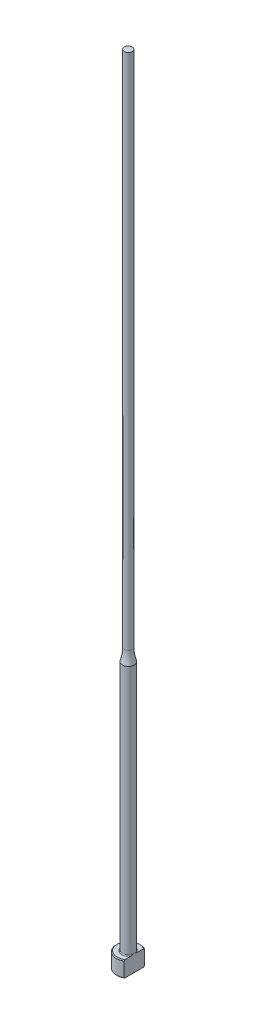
ISO-10303-21;
HEADER;
FILE_DESCRIPTION(('STEP AP214'),'2;1');
FILE_NAME('part.step','',(''),(''),'','','');
FILE_SCHEMA(('AUTOMOTIVE_DESIGN { 1 0 10303 214 1 1 1 1 }'));
ENDSEC;
DATA;
#1=APPLICATION_CONTEXT('core data for automotive mechanical design processes');
#2=APPLICATION_PROTOCOL_DEFINITION('international standard','automotive_design',2000,#1);
#3=PRODUCT_CONTEXT('',#1,'mechanical');
#4=PRODUCT('Part','Part','',(#3));
#5=PRODUCT_RELATED_PRODUCT_CATEGORY('part','',(#4));
#6=PRODUCT_DEFINITION_FORMATION('','',#4);
#7=PRODUCT_DEFINITION_CONTEXT('part definition',#1,'design');
#8=PRODUCT_DEFINITION('design','',#6,#7);
#9=PRODUCT_DEFINITION_SHAPE('','',#8);
#10=(LENGTH_UNIT() NAMED_UNIT(*) SI_UNIT(.MILLI.,.METRE.));
#11=(NAMED_UNIT(*) PLANE_ANGLE_UNIT() SI_UNIT($,.RADIAN.));
#12=(NAMED_UNIT(*) SI_UNIT($,.STERADIAN.) SOLID_ANGLE_UNIT());
#13=UNCERTAINTY_MEASURE_WITH_UNIT(LENGTH_MEASURE(1.E-05),#10,'distance_accuracy_value','');
#14=(GEOMETRIC_REPRESENTATION_CONTEXT(3) GLOBAL_UNCERTAINTY_ASSIGNED_CONTEXT((#13)) GLOBAL_UNIT_ASSIGNED_CONTEXT((#10,
#11,#12)) REPRESENTATION_CONTEXT('',''));
#15=CARTESIAN_POINT('',(0.,0.,0.));
#16=DIRECTION('',(0.,0.,1.));
#17=DIRECTION('',(1.,0.,0.));
#18=AXIS2_PLACEMENT_3D('',#15,#16,#17);
#19=CARTESIAN_POINT('',(-2.99999999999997,4.,0.));
#20=DIRECTION('',(0.,1.,0.));
#21=DIRECTION('',(0.,0.,1.));
#22=AXIS2_PLACEMENT_3D('',#19,#20,#21);
#23=PLANE('',#22);
#24=CARTESIAN_POINT('',(0.,4.,0.));
#25=DIRECTION('',(0.,1.,0.));
#26=DIRECTION('',(0.,0.,1.));
#27=AXIS2_PLACEMENT_3D('',#24,#25,#26);
#28=CIRCLE('',#27,2.79999999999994);
#29=CARTESIAN_POINT('',(1.49999999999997,4.,-2.36431808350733));
#30=VERTEX_POINT('',#29);
#31=CARTESIAN_POINT('',(1.49999999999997,4.,2.36431808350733));
#32=VERTEX_POINT('',#31);
#33=EDGE_CURVE('E187',#30,#32,#28,.T.);
#34=ORIENTED_EDGE('',*,*,#33,.T.);
#35=DIRECTION('',(0.,0.,-1.));
#36=VECTOR('',#35,1.);
#37=CARTESIAN_POINT('',(1.49999999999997,4.,0.));
#38=LINE('',#37,#36);
#39=CARTESIAN_POINT('',(1.49999999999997,3.99999999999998,0.799999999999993));
#40=VERTEX_POINT('',#39);
#41=EDGE_CURVE('E57',#32,#40,#38,.T.);
#42=ORIENTED_EDGE('',*,*,#41,.T.);
#43=CARTESIAN_POINT('',(0.,4.,0.));
#44=DIRECTION('',(0.,1.,0.));
#45=DIRECTION('',(0.,0.,1.));
#46=AXIS2_PLACEMENT_3D('',#43,#44,#45);
#47=CIRCLE('',#46,1.69999999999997);
#48=CARTESIAN_POINT('',(1.49999999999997,3.99999999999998,-0.799999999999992));
#49=VERTEX_POINT('',#48);
#50=EDGE_CURVE('E108',#40,#49,#47,.F.);
#51=ORIENTED_EDGE('',*,*,#50,.T.);
#52=EDGE_CURVE('E137',#49,#30,#38,.T.);
#53=ORIENTED_EDGE('',*,*,#52,.T.);
#54=EDGE_LOOP('',(#34,#42,#51,#53));
#55=FACE_BOUND('',#54,.T.);
#56=ADVANCED_FACE('F32',(#55),#23,.T.);
#57=CARTESIAN_POINT('',(0.,259.958771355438,0.));
#58=DIRECTION('',(0.,1.,0.));
#59=DIRECTION('',(0.,0.,1.));
#60=AXIS2_PLACEMENT_3D('',#57,#58,#59);
#61=CYLINDRICAL_SURFACE('',#60,2.99999999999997);
#62=CARTESIAN_POINT('',(0.,3.79999999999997,0.));
#63=DIRECTION('',(0.,1.,0.));
#64=DIRECTION('',(0.,0.,1.));
#65=AXIS2_PLACEMENT_3D('',#62,#63,#64);
#66=CIRCLE('',#65,2.99999999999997);
#67=CARTESIAN_POINT('',(1.49999999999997,3.79999999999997,2.5980762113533));
#68=VERTEX_POINT('',#67);
#69=CARTESIAN_POINT('',(1.49999999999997,3.79999999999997,-2.5980762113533));
#70=VERTEX_POINT('',#69);
#71=EDGE_CURVE('E105',#68,#70,#66,.F.);
#72=ORIENTED_EDGE('',*,*,#71,.T.);
#73=DIRECTION('',(0.,-1.,0.));
#74=VECTOR('',#73,1.);
#75=CARTESIAN_POINT('',(1.49999999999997,200.,-2.5980762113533));
#76=LINE('',#75,#74);
#77=CARTESIAN_POINT('',(1.49999999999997,0.200000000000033,-2.5980762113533));
#78=VERTEX_POINT('',#77);
#79=EDGE_CURVE('E193',#70,#78,#76,.T.);
#80=ORIENTED_EDGE('',*,*,#79,.T.);
#81=CARTESIAN_POINT('',(0.,0.200000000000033,0.));
#82=DIRECTION('',(0.,-1.,0.));
#83=DIRECTION('',(0.,0.,-1.));
#84=AXIS2_PLACEMENT_3D('',#81,#82,#83);
#85=CIRCLE('',#84,2.99999999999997);
#86=CARTESIAN_POINT('',(1.49999999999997,0.200000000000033,2.5980762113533));
#87=VERTEX_POINT('',#86);
#88=EDGE_CURVE('E100',#78,#87,#85,.F.);
#89=ORIENTED_EDGE('',*,*,#88,.T.);
#90=DIRECTION('',(0.,-1.,0.));
#91=VECTOR('',#90,1.);
#92=CARTESIAN_POINT('',(1.49999999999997,200.,2.5980762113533));
#93=LINE('',#92,#91);
#94=EDGE_CURVE('E93',#68,#87,#93,.T.);
#95=ORIENTED_EDGE('',*,*,#94,.F.);
#96=EDGE_LOOP('',(#72,#80,#89,#95));
#97=FACE_BOUND('',#96,.T.);
#98=ADVANCED_FACE('F158',(#97),#61,.T.);
#99=CARTESIAN_POINT('',(0.,0.,0.));
#100=DIRECTION('',(0.,-1.,0.));
#101=DIRECTION('',(0.,0.,-1.));
#102=AXIS2_PLACEMENT_3D('',#99,#100,#101);
#103=PLANE('',#102);
#104=CARTESIAN_POINT('',(0.,0.,0.));
#105=DIRECTION('',(0.,-1.,0.));
#106=DIRECTION('',(0.,0.,-1.));
#107=AXIS2_PLACEMENT_3D('',#104,#105,#106);
#108=CIRCLE('',#107,2.79999999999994);
#109=CARTESIAN_POINT('',(1.49999999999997,0.,2.36431808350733));
#110=VERTEX_POINT('',#109);
#111=CARTESIAN_POINT('',(1.49999999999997,0.,-2.36431808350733));
#112=VERTEX_POINT('',#111);
#113=EDGE_CURVE('E98',#110,#112,#108,.T.);
#114=ORIENTED_EDGE('',*,*,#113,.T.);
#115=DIRECTION('',(0.,0.,1.));
#116=VECTOR('',#115,1.);
#117=CARTESIAN_POINT('',(1.49999999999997,0.,2.5980762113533));
#118=LINE('',#117,#116);
#119=EDGE_CURVE('E83',#112,#110,#118,.T.);
#120=ORIENTED_EDGE('',*,*,#119,.T.);
#121=EDGE_LOOP('',(#114,#120));
#122=FACE_BOUND('',#121,.T.);
#123=ADVANCED_FACE('F103',(#122),#103,.T.);
#124=CARTESIAN_POINT('',(0.,4.,0.));
#125=DIRECTION('',(0.,-1.,0.));
#126=DIRECTION('',(0.,0.,-1.));
#127=AXIS2_PLACEMENT_3D('',#124,#125,#126);
#128=CONICAL_SURFACE('',#127,2.79999999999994,0.785398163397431);
#129=ORIENTED_EDGE('',*,*,#71,.F.);
#130=CARTESIAN_POINT('',(1.49999999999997,0.888258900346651,5.71827621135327));
#131=CARTESIAN_POINT('',(1.49999999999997,1.01361833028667,5.58866816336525));
#132=CARTESIAN_POINT('',(1.49999999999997,1.13884324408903,5.45892957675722));
#133=CARTESIAN_POINT('',(1.49999999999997,1.38894444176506,5.19911365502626));
#134=CARTESIAN_POINT('',(1.49999999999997,1.51382072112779,5.06903631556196));
#135=CARTESIAN_POINT('',(1.49999999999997,1.76320568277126,4.80840180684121));
#136=CARTESIAN_POINT('',(1.49999999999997,1.88771414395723,4.67784442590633));
#137=CARTESIAN_POINT('',(1.49999999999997,2.13618059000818,4.4162081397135));
#138=CARTESIAN_POINT('',(1.49999999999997,2.26013857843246,4.28512923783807));
#139=CARTESIAN_POINT('',(1.49999999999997,2.50488975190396,4.02490837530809));
#140=CARTESIAN_POINT('',(1.49999999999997,2.62569693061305,3.8957795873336));
#141=CARTESIAN_POINT('',(1.49999999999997,2.86640694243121,3.63668213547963));
#142=CARTESIAN_POINT('',(1.49999999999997,2.98630978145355,3.50671347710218));
#143=CARTESIAN_POINT('',(1.49999999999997,3.22486033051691,3.24567921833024));
#144=CARTESIAN_POINT('',(1.49999999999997,3.3435083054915,3.11461386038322));
#145=CARTESIAN_POINT('',(1.49999999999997,3.5790771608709,2.85094268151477));
#146=CARTESIAN_POINT('',(1.49999999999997,3.69599811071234,2.71833692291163));
#147=CARTESIAN_POINT('',(1.49999999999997,3.88262371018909,2.50255231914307));
#148=CARTESIAN_POINT('',(1.49999999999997,3.95312454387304,2.42006293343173));
#149=CARTESIAN_POINT('',(1.49999999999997,4.09287098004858,2.254010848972));
#150=CARTESIAN_POINT('',(1.49999999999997,4.16211645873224,2.17044804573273));
#151=CARTESIAN_POINT('',(1.49999999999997,4.29964684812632,2.00105967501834));
#152=CARTESIAN_POINT('',(1.49999999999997,4.36791386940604,1.9152195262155));
#153=CARTESIAN_POINT('',(1.49999999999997,4.50205840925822,1.7417139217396));
#154=CARTESIAN_POINT('',(1.49999999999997,4.56793649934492,1.65404891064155));
#155=CARTESIAN_POINT('',(1.49999999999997,4.69728151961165,1.47490236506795));
#156=CARTESIAN_POINT('',(1.49999999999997,4.76069661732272,1.38338308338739));
#157=CARTESIAN_POINT('',(1.49999999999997,4.88239539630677,1.19675661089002));
#158=CARTESIAN_POINT('',(1.49999999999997,4.94067201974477,1.10164473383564));
#159=CARTESIAN_POINT('',(1.49999999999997,5.048413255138,0.908008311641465));
#160=CARTESIAN_POINT('',(1.49999999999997,5.09797809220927,0.809540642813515));
#161=CARTESIAN_POINT('',(1.49999999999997,5.18432188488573,0.607192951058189));
#162=CARTESIAN_POINT('',(1.49999999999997,5.22114374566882,0.50333247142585));
#163=CARTESIAN_POINT('',(1.49999999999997,5.26099935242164,0.347577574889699));
#164=CARTESIAN_POINT('',(1.49999999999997,5.2715702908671,0.297609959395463));
#165=CARTESIAN_POINT('',(1.49999999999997,5.28794860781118,0.196885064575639));
#166=CARTESIAN_POINT('',(1.49999999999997,5.29375640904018,0.146127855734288));
#167=CARTESIAN_POINT('',(1.49999999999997,5.30019707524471,0.0444388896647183));
#168=CARTESIAN_POINT('',(1.49999999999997,5.30084594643,-0.00649183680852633));
#169=CARTESIAN_POINT('',(1.49999999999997,5.29696416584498,-0.108155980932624));
#170=CARTESIAN_POINT('',(1.49999999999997,5.29243308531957,-0.158889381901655));
#171=CARTESIAN_POINT('',(1.49999999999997,5.27856915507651,-0.259234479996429));
#172=CARTESIAN_POINT('',(1.49999999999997,5.2692782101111,-0.308852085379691));
#173=CARTESIAN_POINT('',(1.49999999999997,5.24647108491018,-0.407110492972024));
#174=CARTESIAN_POINT('',(1.49999999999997,5.23295324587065,-0.45575090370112));
#175=CARTESIAN_POINT('',(1.49999999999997,5.20226175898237,-0.55214996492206));
#176=CARTESIAN_POINT('',(1.49999999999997,5.18506801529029,-0.599902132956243));
#177=CARTESIAN_POINT('',(1.49999999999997,5.1477138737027,-0.694205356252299));
#178=CARTESIAN_POINT('',(1.49999999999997,5.12755408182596,-0.740756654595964));
#179=CARTESIAN_POINT('',(1.49999999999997,5.0632769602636,-0.879166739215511));
#180=CARTESIAN_POINT('',(1.49999999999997,5.01551721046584,-0.969329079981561));
#181=CARTESIAN_POINT('',(1.49999999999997,4.91367909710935,-1.14604316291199));
#182=CARTESIAN_POINT('',(1.49999999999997,4.85959300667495,-1.2325903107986));
#183=CARTESIAN_POINT('',(1.49999999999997,4.74697968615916,-1.40321348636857));
#184=CARTESIAN_POINT('',(1.49999999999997,4.68843573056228,-1.4872783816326));
#185=CARTESIAN_POINT('',(1.49999999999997,4.5684384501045,-1.65322187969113));
#186=CARTESIAN_POINT('',(1.49999999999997,4.50698656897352,-1.73510153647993));
#187=CARTESIAN_POINT('',(1.49999999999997,4.3811567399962,-1.89829823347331));
#188=CARTESIAN_POINT('',(1.49999999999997,4.31675092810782,-1.97959369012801));
#189=CARTESIAN_POINT('',(1.49999999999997,4.18634068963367,-2.14090082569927));
#190=CARTESIAN_POINT('',(1.49999999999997,4.12033609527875,-2.22091236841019));
#191=CARTESIAN_POINT('',(1.49999999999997,3.92086431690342,-2.45906508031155));
#192=CARTESIAN_POINT('',(1.49999999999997,3.78562663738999,-2.61572090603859));
#193=CARTESIAN_POINT('',(1.49999999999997,3.53554498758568,-2.90006295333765));
#194=CARTESIAN_POINT('',(1.49999999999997,3.42114543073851,-3.02814382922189));
#195=CARTESIAN_POINT('',(1.49999999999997,3.1909355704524,-3.28303767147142));
#196=CARTESIAN_POINT('',(1.49999999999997,3.07512522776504,-3.40985060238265));
#197=CARTESIAN_POINT('',(1.49999999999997,2.72597067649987,-3.78913849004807));
#198=CARTESIAN_POINT('',(1.49999999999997,2.49111760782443,-4.04022177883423));
#199=CARTESIAN_POINT('',(1.49999999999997,2.0288247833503,-4.52992803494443));
#200=CARTESIAN_POINT('',(1.49999999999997,1.80147747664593,-4.7686387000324));
#201=CARTESIAN_POINT('',(1.49999999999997,1.45954865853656,-5.12558036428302));
#202=CARTESIAN_POINT('',(1.49999999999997,1.34548484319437,-5.24430773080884));
#203=CARTESIAN_POINT('',(1.49999999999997,1.11707176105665,-5.48148573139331));
#204=CARTESIAN_POINT('',(1.49999999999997,1.00272249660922,-5.59993636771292));
#205=CARTESIAN_POINT('',(1.49999999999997,0.888258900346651,-5.71827621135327));
#206=B_SPLINE_CURVE_WITH_KNOTS('',3,(#130,#131,#132,#133,#134,#135,#136,#137,#138,#139,#140,
#141,#142,#143,#144,#145,#146,#147,#148,#149,#150,#151,#152,#153,#154,#155,#156,#157,#158,#159,
#160,#161,#162,#163,#164,#165,#166,#167,#168,#169,#170,#171,#172,#173,#174,#175,#176,#177,#178,
#179,#180,#181,#182,#183,#184,#185,#186,#187,#188,#189,#190,#191,#192,#193,#194,#195,#196,#197,
#198,#199,#200,#201,#202,#203,#204,#205),.UNSPECIFIED.,.F.,.F.,(4,2,2,2,2,2,2,2,2,2,2,2,2,2,2,2,
2,2,2,2,2,2,2,2,2,2,2,2,2,2,2,2,2,2,2,2,2,4),(0.,0.540943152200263,1.08189327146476,
1.62312052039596,2.16434426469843,2.69482920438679,3.22531067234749,3.75567781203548,
4.28602356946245,4.611550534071,4.9371094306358,5.26610945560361,5.59503024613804,
5.92894782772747,6.26331713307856,6.59354403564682,6.92264800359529,7.07567478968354,
7.22868799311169,7.38122626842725,7.53377717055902,7.68500755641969,7.83629736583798,
7.988436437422,8.14054446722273,8.44618799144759,8.75220879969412,9.05944044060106,
9.36652111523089,9.6776428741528,9.98879742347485,10.609592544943,11.1247803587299,
11.6399825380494,12.6713544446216,13.6603005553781,14.1542238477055,14.6481430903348),.UNSPECIFIED.);
#207=EDGE_CURVE('E136',#68,#32,#206,.T.);
#208=ORIENTED_EDGE('',*,*,#207,.T.);
#209=ORIENTED_EDGE('',*,*,#33,.F.);
#210=EDGE_CURVE('E128',#30,#70,#206,.T.);
#211=ORIENTED_EDGE('',*,*,#210,.T.);
#212=EDGE_LOOP('',(#129,#208,#209,#211));
#213=FACE_BOUND('',#212,.T.);
#214=ADVANCED_FACE('F144',(#213),#128,.T.);
#215=CARTESIAN_POINT('',(0.,0.200000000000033,0.));
#216=DIRECTION('',(0.,1.,0.));
#217=DIRECTION('',(0.,0.,1.));
#218=AXIS2_PLACEMENT_3D('',#215,#216,#217);
#219=CONICAL_SURFACE('',#218,2.99999999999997,0.785398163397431);
#220=ORIENTED_EDGE('',*,*,#88,.F.);
#221=CARTESIAN_POINT('',(1.49999999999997,3.11174109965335,-5.71827621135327));
#222=CARTESIAN_POINT('',(1.49999999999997,2.98638166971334,-5.58866816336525));
#223=CARTESIAN_POINT('',(1.49999999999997,2.86115675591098,-5.45892957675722));
#224=CARTESIAN_POINT('',(1.49999999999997,2.61105555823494,-5.19911365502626));
#225=CARTESIAN_POINT('',(1.49999999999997,2.48617927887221,-5.06903631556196));
#226=CARTESIAN_POINT('',(1.49999999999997,2.23679431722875,-4.80840180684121));
#227=CARTESIAN_POINT('',(1.49999999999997,2.11228585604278,-4.67784442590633));
#228=CARTESIAN_POINT('',(1.49999999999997,1.86381940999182,-4.4162081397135));
#229=CARTESIAN_POINT('',(1.49999999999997,1.73986142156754,-4.28512923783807));
#230=CARTESIAN_POINT('',(1.49999999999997,1.49511024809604,-4.02490837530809));
#231=CARTESIAN_POINT('',(1.49999999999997,1.37430306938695,-3.8957795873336));
#232=CARTESIAN_POINT('',(1.49999999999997,1.13359305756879,-3.63668213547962));
#233=CARTESIAN_POINT('',(1.49999999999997,1.01369021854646,-3.50671347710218));
#234=CARTESIAN_POINT('',(1.49999999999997,0.775139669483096,-3.24567921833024));
#235=CARTESIAN_POINT('',(1.49999999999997,0.656491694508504,-3.11461386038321));
#236=CARTESIAN_POINT('',(1.49999999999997,0.420922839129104,-2.85094268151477));
#237=CARTESIAN_POINT('',(1.49999999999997,0.304001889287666,-2.71833692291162));
#238=CARTESIAN_POINT('',(1.49999999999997,0.117376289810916,-2.50255231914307));
#239=CARTESIAN_POINT('',(1.49999999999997,0.0468754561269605,-2.42006293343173));
#240=CARTESIAN_POINT('',(1.49999999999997,-0.0928709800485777,-2.254010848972));
#241=CARTESIAN_POINT('',(1.49999999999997,-0.162116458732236,-2.17044804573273));
#242=CARTESIAN_POINT('',(1.49999999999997,-0.299646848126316,-2.00105967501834));
#243=CARTESIAN_POINT('',(1.49999999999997,-0.367913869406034,-1.9152195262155));
#244=CARTESIAN_POINT('',(1.49999999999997,-0.502058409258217,-1.7417139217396));
#245=CARTESIAN_POINT('',(1.49999999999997,-0.567936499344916,-1.65404891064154));
#246=CARTESIAN_POINT('',(1.49999999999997,-0.697281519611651,-1.47490236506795));
#247=CARTESIAN_POINT('',(1.49999999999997,-0.760696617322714,-1.38338308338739));
#248=CARTESIAN_POINT('',(1.49999999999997,-0.882395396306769,-1.19675661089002));
#249=CARTESIAN_POINT('',(1.49999999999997,-0.940672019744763,-1.10164473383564));
#250=CARTESIAN_POINT('',(1.49999999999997,-1.048413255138,-0.908008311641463));
#251=CARTESIAN_POINT('',(1.49999999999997,-1.09797809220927,-0.809540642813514));
#252=CARTESIAN_POINT('',(1.49999999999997,-1.18432188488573,-0.607192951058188));
#253=CARTESIAN_POINT('',(1.49999999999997,-1.22114374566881,-0.503332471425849));
#254=CARTESIAN_POINT('',(1.49999999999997,-1.26099935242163,-0.347577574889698));
#255=CARTESIAN_POINT('',(1.49999999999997,-1.2715702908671,-0.297609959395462));
#256=CARTESIAN_POINT('',(1.49999999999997,-1.28794860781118,-0.196885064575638));
#257=CARTESIAN_POINT('',(1.49999999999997,-1.29375640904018,-0.146127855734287));
#258=CARTESIAN_POINT('',(1.49999999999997,-1.30019707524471,-0.0444388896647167));
#259=CARTESIAN_POINT('',(1.49999999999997,-1.30084594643,0.00649183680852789));
#260=CARTESIAN_POINT('',(1.49999999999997,-1.29696416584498,0.108155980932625));
#261=CARTESIAN_POINT('',(1.49999999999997,-1.29243308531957,0.158889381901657));
#262=CARTESIAN_POINT('',(1.49999999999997,-1.2785691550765,0.259234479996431));
#263=CARTESIAN_POINT('',(1.49999999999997,-1.2692782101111,0.308852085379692));
#264=CARTESIAN_POINT('',(1.49999999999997,-1.24647108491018,0.407110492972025));
#265=CARTESIAN_POINT('',(1.49999999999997,-1.23295324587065,0.455750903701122));
#266=CARTESIAN_POINT('',(1.49999999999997,-1.20226175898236,0.552149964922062));
#267=CARTESIAN_POINT('',(1.49999999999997,-1.18506801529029,0.599902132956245));
#268=CARTESIAN_POINT('',(1.49999999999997,-1.14771387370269,0.694205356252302));
#269=CARTESIAN_POINT('',(1.49999999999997,-1.12755408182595,0.740756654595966));
#270=CARTESIAN_POINT('',(1.49999999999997,-1.0632769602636,0.879166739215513));
#271=CARTESIAN_POINT('',(1.49999999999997,-1.01551721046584,0.969329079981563));
#272=CARTESIAN_POINT('',(1.49999999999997,-0.913679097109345,1.14604316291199));
#273=CARTESIAN_POINT('',(1.49999999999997,-0.859593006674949,1.2325903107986));
#274=CARTESIAN_POINT('',(1.49999999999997,-0.746979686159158,1.40321348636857));
#275=CARTESIAN_POINT('',(1.49999999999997,-0.688435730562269,1.4872783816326));
#276=CARTESIAN_POINT('',(1.49999999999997,-0.568438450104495,1.65322187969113));
#277=CARTESIAN_POINT('',(1.49999999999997,-0.506986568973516,1.73510153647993));
#278=CARTESIAN_POINT('',(1.49999999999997,-0.381156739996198,1.89829823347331));
#279=CARTESIAN_POINT('',(1.49999999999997,-0.316750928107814,1.97959369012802));
#280=CARTESIAN_POINT('',(1.49999999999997,-0.186340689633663,2.14090082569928));
#281=CARTESIAN_POINT('',(1.49999999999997,-0.12033609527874,2.22091236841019));
#282=CARTESIAN_POINT('',(1.49999999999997,0.0791356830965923,2.45906508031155));
#283=CARTESIAN_POINT('',(1.49999999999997,0.214373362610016,2.61572090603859));
#284=CARTESIAN_POINT('',(1.49999999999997,0.46445501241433,2.90006295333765));
#285=CARTESIAN_POINT('',(1.49999999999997,0.578854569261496,3.02814382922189));
#286=CARTESIAN_POINT('',(1.49999999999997,0.809064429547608,3.28303767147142));
#287=CARTESIAN_POINT('',(1.49999999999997,0.924874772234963,3.40985060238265));
#288=CARTESIAN_POINT('',(1.49999999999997,1.27402932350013,3.78913849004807));
#289=CARTESIAN_POINT('',(1.49999999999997,1.50888239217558,4.04022177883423));
#290=CARTESIAN_POINT('',(1.49999999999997,1.97117521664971,4.52992803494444));
#291=CARTESIAN_POINT('',(1.49999999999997,2.19852252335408,4.76863870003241));
#292=CARTESIAN_POINT('',(1.49999999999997,2.54045134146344,5.12558036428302));
#293=CARTESIAN_POINT('',(1.49999999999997,2.65451515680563,5.24430773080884));
#294=CARTESIAN_POINT('',(1.49999999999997,2.88292823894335,5.48148573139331));
#295=CARTESIAN_POINT('',(1.49999999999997,2.99727750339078,5.59993636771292));
#296=CARTESIAN_POINT('',(1.49999999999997,3.11174109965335,5.71827621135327));
#297=B_SPLINE_CURVE_WITH_KNOTS('',3,(#221,#222,#223,#224,#225,#226,#227,#228,#229,#230,#231,
#232,#233,#234,#235,#236,#237,#238,#239,#240,#241,#242,#243,#244,#245,#246,#247,#248,#249,#250,
#251,#252,#253,#254,#255,#256,#257,#258,#259,#260,#261,#262,#263,#264,#265,#266,#267,#268,#269,
#270,#271,#272,#273,#274,#275,#276,#277,#278,#279,#280,#281,#282,#283,#284,#285,#286,#287,#288,
#289,#290,#291,#292,#293,#294,#295,#296),.UNSPECIFIED.,.F.,.F.,(4,2,2,2,2,2,2,2,2,2,2,2,2,2,2,2,
2,2,2,2,2,2,2,2,2,2,2,2,2,2,2,2,2,2,2,2,2,4),(0.,0.540943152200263,1.08189327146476,
1.62312052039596,2.16434426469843,2.69482920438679,3.22531067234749,3.75567781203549,
4.28602356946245,4.611550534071,4.9371094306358,5.26610945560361,5.59503024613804,
5.92894782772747,6.26331713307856,6.59354403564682,6.92264800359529,7.07567478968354,
7.2286879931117,7.38122626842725,7.53377717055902,7.6850075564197,7.83629736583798,
7.98843643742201,8.14054446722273,8.44618799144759,8.75220879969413,9.05944044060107,
9.3665211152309,9.6776428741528,9.98879742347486,10.609592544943,11.1247803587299,
11.6399825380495,12.6713544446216,13.6603005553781,14.1542238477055,14.6481430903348),.UNSPECIFIED.);
#298=EDGE_CURVE('E86',#78,#112,#297,.T.);
#299=ORIENTED_EDGE('',*,*,#298,.T.);
#300=ORIENTED_EDGE('',*,*,#113,.F.);
#301=EDGE_CURVE('E89',#110,#87,#297,.T.);
#302=ORIENTED_EDGE('',*,*,#301,.T.);
#303=EDGE_LOOP('',(#220,#299,#300,#302));
#304=FACE_BOUND('',#303,.T.);
#305=ADVANCED_FACE('F97',(#304),#219,.T.);
#306=CARTESIAN_POINT('',(0.,4.19999999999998,0.));
#307=DIRECTION('',(0.,1.,0.));
#308=DIRECTION('',(0.,0.,1.));
#309=AXIS2_PLACEMENT_3D('',#306,#307,#308);
#310=TOROIDAL_SURFACE('',#309,1.69999999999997,0.2);
#311=CARTESIAN_POINT('',(1.49999999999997,4.19999999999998,0.));
#312=CARTESIAN_POINT('',(1.49999999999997,4.20000050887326,7.14686674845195E-11));
#313=CARTESIAN_POINT('',(1.49999999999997,4.20000101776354,-1.21663673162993E-07));
#314=CARTESIAN_POINT('',(1.49999999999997,4.20000199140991,-4.97616237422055E-07));
#315=CARTESIAN_POINT('',(1.49999999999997,4.20000245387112,-7.56516220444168E-07));
#316=CARTESIAN_POINT('',(1.49999999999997,4.20000338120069,-1.37642837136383E-06));
#317=CARTESIAN_POINT('',(1.49999999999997,4.20000384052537,-1.74563476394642E-06));
#318=CARTESIAN_POINT('',(1.49999999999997,4.20000469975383,-2.53565984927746E-06));
#319=CARTESIAN_POINT('',(1.49999999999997,4.20000510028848,-2.95582597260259E-06));
#320=CARTESIAN_POINT('',(1.49999999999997,4.20000646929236,-4.48430445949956E-06));
#321=CARTESIAN_POINT('',(1.49999999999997,4.20000736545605,-5.6586103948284E-06));
#322=CARTESIAN_POINT('',(1.49999999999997,4.20000893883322,-8.06479202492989E-06));
#323=CARTESIAN_POINT('',(1.49999999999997,4.20000962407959,-9.29170517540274E-06));
#324=CARTESIAN_POINT('',(1.49999999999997,4.20001225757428,-1.416232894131E-05));
#325=CARTESIAN_POINT('',(1.49999999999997,4.20001407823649,-1.78790031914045E-05));
#326=CARTESIAN_POINT('',(1.49999999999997,4.20001699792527,-2.51443066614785E-05));
#327=CARTESIAN_POINT('',(1.49999999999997,4.20001815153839,-2.86715394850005E-05));
#328=CARTESIAN_POINT('',(1.49999999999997,4.20002315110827,-4.39218128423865E-05));
#329=CARTESIAN_POINT('',(1.49999999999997,4.20002701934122,-5.56288390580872E-05));
#330=CARTESIAN_POINT('',(1.49999999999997,4.20003312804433,-7.7405829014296E-05));
#331=CARTESIAN_POINT('',(1.49999999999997,4.20003553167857,-8.74278412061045E-05));
#332=CARTESIAN_POINT('',(1.49999999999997,4.20005483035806,-0.000161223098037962));
#333=CARTESIAN_POINT('',(1.49999999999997,4.20007979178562,-0.000222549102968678));
#334=CARTESIAN_POINT('',(1.49999999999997,4.20017391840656,-0.000462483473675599));
#335=CARTESIAN_POINT('',(1.49999999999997,4.20023706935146,-0.000642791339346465));
#336=CARTESIAN_POINT('',(1.49999999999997,4.20048761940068,-0.00134785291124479));
#337=CARTESIAN_POINT('',(1.49999999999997,4.20068132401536,-0.00187087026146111));
#338=CARTESIAN_POINT('',(1.49999999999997,4.20147357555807,-0.00402004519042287));
#339=CARTESIAN_POINT('',(1.49999999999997,4.20206499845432,-0.0056481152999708));
#340=CARTESIAN_POINT('',(1.49999999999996,4.20892634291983,-0.0245232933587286));
#341=CARTESIAN_POINT('',(1.49999999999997,4.21523683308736,-0.041759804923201));
#342=CARTESIAN_POINT('',(1.49999999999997,4.22755028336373,-0.0756091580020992));
#343=CARTESIAN_POINT('',(1.49999999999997,4.23355589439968,-0.0922211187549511));
#344=CARTESIAN_POINT('',(1.49999999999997,4.24620101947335,-0.127454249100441));
#345=CARTESIAN_POINT('',(1.49999999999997,4.25283080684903,-0.146078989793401));
#346=CARTESIAN_POINT('',(1.49999999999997,4.26599765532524,-0.183577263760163));
#347=CARTESIAN_POINT('',(1.49999999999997,4.27253305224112,-0.202451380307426));
#348=CARTESIAN_POINT('',(1.49999999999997,4.28834228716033,-0.248982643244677));
#349=CARTESIAN_POINT('',(1.49999999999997,4.2974915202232,-0.276682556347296));
#350=CARTESIAN_POINT('',(1.49999999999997,4.31490935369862,-0.331625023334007));
#351=CARTESIAN_POINT('',(1.49999999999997,4.3231938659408,-0.358862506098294));
#352=CARTESIAN_POINT('',(1.49999999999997,4.34051594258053,-0.419125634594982));
#353=CARTESIAN_POINT('',(1.49999999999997,4.34936607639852,-0.452206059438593));
#354=CARTESIAN_POINT('',(1.49999999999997,4.36549583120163,-0.519023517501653));
#355=CARTESIAN_POINT('',(1.49999999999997,4.37276283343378,-0.552763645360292));
#356=CARTESIAN_POINT('',(1.49999999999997,4.38554755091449,-0.62305310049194));
#357=CARTESIAN_POINT('',(1.49999999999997,4.39090573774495,-0.65963271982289));
#358=CARTESIAN_POINT('',(1.49999999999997,4.39825016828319,-0.733028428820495));
#359=CARTESIAN_POINT('',(1.49999999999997,4.40024734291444,-0.76984335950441));
#360=CARTESIAN_POINT('',(1.49999999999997,4.39970780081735,-0.842856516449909));
#361=CARTESIAN_POINT('',(1.49999999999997,4.39725347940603,-0.879053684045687));
#362=CARTESIAN_POINT('',(1.49999999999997,4.38900085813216,-0.93238076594));
#363=CARTESIAN_POINT('',(1.49999999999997,4.38553049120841,-0.949868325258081));
#364=CARTESIAN_POINT('',(1.49999999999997,4.37678336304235,-0.984374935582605));
#365=CARTESIAN_POINT('',(1.49999999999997,4.37150943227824,-1.00139467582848));
#366=CARTESIAN_POINT('',(1.49999999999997,4.35869781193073,-1.03479423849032));
#367=CARTESIAN_POINT('',(1.49999999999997,4.3511359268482,-1.05116499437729));
#368=CARTESIAN_POINT('',(1.49999999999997,4.33325333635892,-1.08234828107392));
#369=CARTESIAN_POINT('',(1.49999999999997,4.32294266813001,-1.09716621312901));
#370=CARTESIAN_POINT('',(1.49999999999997,4.30512758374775,-1.11714173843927));
#371=CARTESIAN_POINT('',(1.49999999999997,4.29884721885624,-1.12339066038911));
#372=CARTESIAN_POINT('',(1.49999999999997,4.28545950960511,-1.13494695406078));
#373=CARTESIAN_POINT('',(1.49999999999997,4.27835226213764,-1.14025443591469));
#374=CARTESIAN_POINT('',(1.49999999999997,4.26325970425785,-1.14967631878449));
#375=CARTESIAN_POINT('',(1.49999999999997,4.25526534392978,-1.15377649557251));
#376=CARTESIAN_POINT('',(1.49999999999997,4.23863207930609,-1.16034952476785));
#377=CARTESIAN_POINT('',(1.49999999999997,4.22999427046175,-1.16282507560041));
#378=CARTESIAN_POINT('',(1.49999999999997,4.21343922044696,-1.16570267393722));
#379=CARTESIAN_POINT('',(1.49999999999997,4.20555896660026,-1.16631687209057));
#380=CARTESIAN_POINT('',(1.49999999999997,4.18982775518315,-1.16602054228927));
#381=CARTESIAN_POINT('',(1.49999999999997,4.18197679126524,-1.16511036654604));
#382=CARTESIAN_POINT('',(1.49999999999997,4.16747846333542,-1.16204446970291));
#383=CARTESIAN_POINT('',(1.49999999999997,4.16079696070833,-1.16004509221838));
#384=CARTESIAN_POINT('',(1.49999999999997,4.14781700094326,-1.15505972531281));
#385=CARTESIAN_POINT('',(1.49999999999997,4.14151862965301,-1.1520735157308));
#386=CARTESIAN_POINT('',(1.49999999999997,4.12690214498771,-1.14387585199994));
#387=CARTESIAN_POINT('',(1.49999999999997,4.11881436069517,-1.13825400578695));
#388=CARTESIAN_POINT('',(1.49999999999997,4.1036444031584,-1.12578441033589));
#389=CARTESIAN_POINT('',(1.49999999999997,4.09656475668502,-1.11893367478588));
#390=CARTESIAN_POINT('',(1.49999999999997,4.08012297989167,-1.10074342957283));
#391=CARTESIAN_POINT('',(1.49999999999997,4.07136543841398,-1.08886044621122));
#392=CARTESIAN_POINT('',(1.49999999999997,4.05578194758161,-1.06392743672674));
#393=CARTESIAN_POINT('',(1.49999999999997,4.0489571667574,-1.05087671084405));
#394=CARTESIAN_POINT('',(1.49999999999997,4.03273856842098,-1.01472307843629));
#395=CARTESIAN_POINT('',(1.49999999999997,4.02486230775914,-0.990945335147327));
#396=CARTESIAN_POINT('',(1.49999999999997,4.01257693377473,-0.94232199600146));
#397=CARTESIAN_POINT('',(1.49999999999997,4.00820590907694,-0.917467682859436));
#398=CARTESIAN_POINT('',(1.49999999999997,4.00229956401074,-0.867912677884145));
#399=CARTESIAN_POINT('',(1.49999999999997,4.0007128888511,-0.843217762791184));
#400=CARTESIAN_POINT('',(1.49999999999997,3.9996723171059,-0.79374605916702));
#401=CARTESIAN_POINT('',(1.49999999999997,4.0002230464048,-0.768969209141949));
#402=CARTESIAN_POINT('',(1.49999999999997,4.00433101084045,-0.696994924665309));
#403=CARTESIAN_POINT('',(1.49999999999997,4.01016976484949,-0.64993124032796));
#404=CARTESIAN_POINT('',(1.49999999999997,4.02567776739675,-0.559166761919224));
#405=CARTESIAN_POINT('',(1.49999999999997,4.03511950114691,-0.515423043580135));
#406=CARTESIAN_POINT('',(1.49999999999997,4.05693059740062,-0.427590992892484));
#407=CARTESIAN_POINT('',(1.49999999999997,4.06936356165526,-0.383518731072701));
#408=CARTESIAN_POINT('',(1.49999999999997,4.09174953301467,-0.310161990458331));
#409=CARTESIAN_POINT('',(1.49999999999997,4.10119843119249,-0.280718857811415));
#410=CARTESIAN_POINT('',(1.49999999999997,4.12060442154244,-0.22234098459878));
#411=CARTESIAN_POINT('',(1.49999999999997,4.13055519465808,-0.193404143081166));
#412=CARTESIAN_POINT('',(1.49999999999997,4.14973721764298,-0.138756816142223));
#413=CARTESIAN_POINT('',(1.49999999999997,4.15893123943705,-0.113033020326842));
#414=CARTESIAN_POINT('',(1.49999999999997,4.17788037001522,-0.0606351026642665));
#415=CARTESIAN_POINT('',(1.49999999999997,4.18764328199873,-0.0339636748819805));
#416=CARTESIAN_POINT('',(1.49999999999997,4.19793548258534,-0.00564657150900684));
#417=CARTESIAN_POINT('',(1.49999999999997,4.19852751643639,-0.00401699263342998));
#418=CARTESIAN_POINT('',(1.49999999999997,4.1993199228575,-0.0018674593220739));
#419=CARTESIAN_POINT('',(1.49999999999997,4.19951319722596,-0.00134559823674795));
#420=CARTESIAN_POINT('',(1.49999999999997,4.19976322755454,-0.000641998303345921));
#421=CARTESIAN_POINT('',(1.49999999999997,4.19982627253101,-0.000461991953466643));
#422=CARTESIAN_POINT('',(1.49999999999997,4.19992025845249,-0.000222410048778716));
#423=CARTESIAN_POINT('',(1.49999999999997,4.19994519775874,-0.000161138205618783));
#424=CARTESIAN_POINT('',(1.49999999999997,4.19996448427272,-8.74039267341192E-05));
#425=CARTESIAN_POINT('',(1.49999999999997,4.19996688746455,-7.73857556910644E-05));
#426=CARTESIAN_POINT('',(1.49999999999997,4.1999729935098,-5.56173272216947E-05));
#427=CARTESIAN_POINT('',(1.49999999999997,4.19997685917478,-4.39149186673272E-05));
#428=CARTESIAN_POINT('',(1.49999999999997,4.19998185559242,-2.86698156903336E-05));
#429=CARTESIAN_POINT('',(1.49999999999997,4.19998300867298,-2.51431575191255E-05));
#430=CARTESIAN_POINT('',(1.49999999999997,4.19998592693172,-1.78789552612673E-05));
#431=CARTESIAN_POINT('',(1.49999999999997,4.19998774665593,-1.41627846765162E-05));
#432=CARTESIAN_POINT('',(1.49999999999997,4.19999037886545,-9.29264488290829E-06));
#433=CARTESIAN_POINT('',(1.49999999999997,4.19999106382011,-8.06577599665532E-06));
#434=CARTESIAN_POINT('',(1.49999999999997,4.19999263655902,-5.65962639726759E-06));
#435=CARTESIAN_POINT('',(1.49999999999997,4.19999353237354,-4.48530466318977E-06));
#436=CARTESIAN_POINT('',(1.49999999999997,4.19999490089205,-2.95673740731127E-06));
#437=CARTESIAN_POINT('',(1.49999999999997,4.1999953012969,-2.53653208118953E-06));
#438=CARTESIAN_POINT('',(1.49999999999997,4.19999616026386,-1.74640525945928E-06));
#439=CARTESIAN_POINT('',(1.49999999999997,4.19999661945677,-1.37713598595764E-06));
#440=CARTESIAN_POINT('',(1.49999999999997,4.19999754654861,-7.57072336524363E-07));
#441=CARTESIAN_POINT('',(1.49999999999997,4.19999800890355,-4.9808738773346E-07));
#442=CARTESIAN_POINT('',(1.49999999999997,4.19999898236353,-1.21927249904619E-07));
#443=CARTESIAN_POINT('',(1.49999999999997,4.19999949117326,-7.14621294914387E-11));
#444=CARTESIAN_POINT('',(1.49999999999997,4.19999999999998,0.));
#445=B_SPLINE_CURVE_WITH_KNOTS('',3,(#311,#312,#313,#314,#315,#316,#317,#318,#319,#320,#321,
#322,#323,#324,#325,#326,#327,#328,#329,#330,#331,#332,#333,#334,#335,#336,#337,#338,#339,#340,
#341,#342,#343,#344,#345,#346,#347,#348,#349,#350,#351,#352,#353,#354,#355,#356,#357,#358,#359,
#360,#361,#362,#363,#364,#365,#366,#367,#368,#369,#370,#371,#372,#373,#374,#375,#376,#377,#378,
#379,#380,#381,#382,#383,#384,#385,#386,#387,#388,#389,#390,#391,#392,#393,#394,#395,#396,#397,
#398,#399,#400,#401,#402,#403,#404,#405,#406,#407,#408,#409,#410,#411,#412,#413,#414,#415,#416,
#417,#418,#419,#420,#421,#422,#423,#424,#425,#426,#427,#428,#429,#430,#431,#432,#433,#434,#435,
#436,#437,#438,#439,#440,#441,#442,#443,#444),.UNSPECIFIED.,.T.,.F.,(4,2,2,2,2,2,2,2,2,2,2,2,2,
2,2,2,2,2,2,2,2,2,2,2,2,2,2,2,2,2,2,2,2,2,2,2,2,2,2,2,2,2,2,2,2,2,2,2,2,2,2,2,2,2,2,2,2,2,2,2,2,
2,2,2,2,2,4),(0.,1.5268750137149E-06,3.10959387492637E-06,4.86976756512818E-06,
6.60940084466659E-06,1.10202525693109E-05,1.5232779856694E-05,2.7614037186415E-05,
3.87351645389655E-05,7.57188332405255E-05,0.000106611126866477,0.000304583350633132,
0.00087827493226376,0.00255078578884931,0.0077480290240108,0.0628090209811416,0.115802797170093,
0.175110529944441,0.23503061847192,0.32253950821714,0.407938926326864,0.510638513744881,
0.614128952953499,0.724918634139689,0.835347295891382,0.943752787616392,0.997165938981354,
1.05049564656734,1.10441029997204,1.15813071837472,1.18463966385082,1.21114550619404,
1.23795217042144,1.26471419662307,1.2882832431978,1.31184684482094,1.33268332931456,
1.35352446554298,1.38290826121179,1.41236445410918,1.45639976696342,1.50046164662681,
1.57518788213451,1.65071550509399,1.72483484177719,1.79911468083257,1.94105061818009,
2.07520625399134,2.2125154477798,2.30527614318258,2.39707056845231,2.47902409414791,
2.56422207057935,2.56942417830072,2.57109299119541,2.57166572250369,2.57186352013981,
2.57189440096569,2.57193136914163,2.57194248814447,2.57195486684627,2.57195907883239,
2.57196348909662,2.57196522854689,2.57196698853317,2.57196857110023,2.57197009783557),.UNSPECIFIED.);
#446=CARTESIAN_POINT('',(1.49999999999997,4.19999999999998,0.));
#447=VERTEX_POINT('',#446);
#448=EDGE_CURVE('E11',#49,#447,#445,.T.);
#449=ORIENTED_EDGE('',*,*,#448,.F.);
#450=ORIENTED_EDGE('',*,*,#50,.F.);
#451=CARTESIAN_POINT('',(1.49999999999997,4.19999999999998,0.));
#452=CARTESIAN_POINT('',(1.49999999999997,4.1999994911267,-7.1468641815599E-11));
#453=CARTESIAN_POINT('',(1.49999999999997,4.19999898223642,1.21663673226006E-07));
#454=CARTESIAN_POINT('',(1.49999999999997,4.19999800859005,4.97616237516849E-07));
#455=CARTESIAN_POINT('',(1.49999999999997,4.19999754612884,7.56516220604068E-07));
#456=CARTESIAN_POINT('',(1.49999999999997,4.19999661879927,1.37642837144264E-06));
#457=CARTESIAN_POINT('',(1.49999999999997,4.1999961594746,1.74563476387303E-06));
#458=CARTESIAN_POINT('',(1.49999999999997,4.19999530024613,2.5356598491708E-06));
#459=CARTESIAN_POINT('',(1.49999999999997,4.19999489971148,2.95582597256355E-06));
#460=CARTESIAN_POINT('',(1.49999999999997,4.1999935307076,4.48430445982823E-06));
#461=CARTESIAN_POINT('',(1.49999999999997,4.19999263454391,5.6586103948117E-06));
#462=CARTESIAN_POINT('',(1.49999999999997,4.19999106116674,8.06479202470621E-06));
#463=CARTESIAN_POINT('',(1.49999999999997,4.19999037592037,9.29170517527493E-06));
#464=CARTESIAN_POINT('',(1.49999999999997,4.19998774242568,1.41623289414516E-05));
#465=CARTESIAN_POINT('',(1.49999999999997,4.19998592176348,1.78790031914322E-05));
#466=CARTESIAN_POINT('',(1.49999999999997,4.1999830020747,2.51443066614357E-05));
#467=CARTESIAN_POINT('',(1.49999999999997,4.19998184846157,2.86715394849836E-05));
#468=CARTESIAN_POINT('',(1.49999999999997,4.1999768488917,4.39218128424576E-05));
#469=CARTESIAN_POINT('',(1.49999999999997,4.19997298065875,5.56288390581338E-05));
#470=CARTESIAN_POINT('',(1.49999999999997,4.19996687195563,7.7405829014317E-05));
#471=CARTESIAN_POINT('',(1.49999999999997,4.19996446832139,8.74278412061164E-05));
#472=CARTESIAN_POINT('',(1.49999999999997,4.1999451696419,0.000161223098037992));
#473=CARTESIAN_POINT('',(1.49999999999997,4.19992020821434,0.000222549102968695));
#474=CARTESIAN_POINT('',(1.49999999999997,4.19982608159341,0.000462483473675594));
#475=CARTESIAN_POINT('',(1.49999999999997,4.1997629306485,0.000642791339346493));
#476=CARTESIAN_POINT('',(1.49999999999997,4.19951238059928,0.00134785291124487));
#477=CARTESIAN_POINT('',(1.49999999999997,4.19931867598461,0.00187087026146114));
#478=CARTESIAN_POINT('',(1.49999999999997,4.19852642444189,0.00402004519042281));
#479=CARTESIAN_POINT('',(1.49999999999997,4.19793500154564,0.00564811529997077));
#480=CARTESIAN_POINT('',(1.49999999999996,4.19107365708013,0.0245232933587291));
#481=CARTESIAN_POINT('',(1.49999999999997,4.1847631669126,0.0417598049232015));
#482=CARTESIAN_POINT('',(1.49999999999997,4.17244971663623,0.0756091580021));
#483=CARTESIAN_POINT('',(1.49999999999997,4.16644410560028,0.0922211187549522));
#484=CARTESIAN_POINT('',(1.49999999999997,4.15379898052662,0.127454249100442));
#485=CARTESIAN_POINT('',(1.49999999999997,4.14716919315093,0.146078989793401));
#486=CARTESIAN_POINT('',(1.49999999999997,4.13400234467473,0.183577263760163));
#487=CARTESIAN_POINT('',(1.49999999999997,4.12746694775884,0.202451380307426));
#488=CARTESIAN_POINT('',(1.49999999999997,4.11165771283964,0.248982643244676));
#489=CARTESIAN_POINT('',(1.49999999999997,4.10250847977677,0.276682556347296));
#490=CARTESIAN_POINT('',(1.49999999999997,4.08509064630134,0.331625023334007));
#491=CARTESIAN_POINT('',(1.49999999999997,4.07680613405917,0.358862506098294));
#492=CARTESIAN_POINT('',(1.49999999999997,4.05948405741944,0.419125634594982));
#493=CARTESIAN_POINT('',(1.49999999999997,4.05063392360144,0.452206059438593));
#494=CARTESIAN_POINT('',(1.49999999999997,4.03450416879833,0.519023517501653));
#495=CARTESIAN_POINT('',(1.49999999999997,4.02723716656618,0.552763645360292));
#496=CARTESIAN_POINT('',(1.49999999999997,4.01445244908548,0.62305310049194));
#497=CARTESIAN_POINT('',(1.49999999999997,4.00909426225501,0.659632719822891));
#498=CARTESIAN_POINT('',(1.49999999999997,4.00174983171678,0.733028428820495));
#499=CARTESIAN_POINT('',(1.49999999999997,3.99975265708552,0.76984335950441));
#500=CARTESIAN_POINT('',(1.49999999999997,4.00029219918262,0.842856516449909));
#501=CARTESIAN_POINT('',(1.49999999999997,4.00274652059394,0.879053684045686));
#502=CARTESIAN_POINT('',(1.49999999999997,4.0109991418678,0.93238076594));
#503=CARTESIAN_POINT('',(1.49999999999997,4.01446950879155,0.949868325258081));
#504=CARTESIAN_POINT('',(1.49999999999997,4.02321663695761,0.984374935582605));
#505=CARTESIAN_POINT('',(1.49999999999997,4.02849056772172,1.00139467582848));
#506=CARTESIAN_POINT('',(1.49999999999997,4.04130218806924,1.03479423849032));
#507=CARTESIAN_POINT('',(1.49999999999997,4.04886407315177,1.05116499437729));
#508=CARTESIAN_POINT('',(1.49999999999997,4.06674666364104,1.08234828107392));
#509=CARTESIAN_POINT('',(1.49999999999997,4.07705733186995,1.09716621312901));
#510=CARTESIAN_POINT('',(1.49999999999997,4.09487241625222,1.11714173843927));
#511=CARTESIAN_POINT('',(1.49999999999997,4.10115278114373,1.12339066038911));
#512=CARTESIAN_POINT('',(1.49999999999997,4.11454049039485,1.13494695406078));
#513=CARTESIAN_POINT('',(1.49999999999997,4.12164773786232,1.14025443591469));
#514=CARTESIAN_POINT('',(1.49999999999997,4.13674029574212,1.14967631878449));
#515=CARTESIAN_POINT('',(1.49999999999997,4.14473465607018,1.15377649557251));
#516=CARTESIAN_POINT('',(1.49999999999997,4.16136792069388,1.16034952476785));
#517=CARTESIAN_POINT('',(1.49999999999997,4.17000572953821,1.16282507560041));
#518=CARTESIAN_POINT('',(1.49999999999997,4.186560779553,1.16570267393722));
#519=CARTESIAN_POINT('',(1.49999999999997,4.1944410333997,1.16631687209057));
#520=CARTESIAN_POINT('',(1.49999999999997,4.21017224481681,1.16602054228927));
#521=CARTESIAN_POINT('',(1.49999999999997,4.21802320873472,1.16511036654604));
#522=CARTESIAN_POINT('',(1.49999999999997,4.23252153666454,1.16204446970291));
#523=CARTESIAN_POINT('',(1.49999999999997,4.23920303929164,1.16004509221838));
#524=CARTESIAN_POINT('',(1.49999999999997,4.2521829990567,1.15505972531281));
#525=CARTESIAN_POINT('',(1.49999999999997,4.25848137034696,1.1520735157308));
#526=CARTESIAN_POINT('',(1.49999999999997,4.27309785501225,1.14387585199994));
#527=CARTESIAN_POINT('',(1.49999999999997,4.28118563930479,1.13825400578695));
#528=CARTESIAN_POINT('',(1.49999999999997,4.29635559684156,1.12578441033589));
#529=CARTESIAN_POINT('',(1.49999999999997,4.30343524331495,1.11893367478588));
#530=CARTESIAN_POINT('',(1.49999999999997,4.31987702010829,1.10074342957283));
#531=CARTESIAN_POINT('',(1.49999999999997,4.32863456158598,1.08886044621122));
#532=CARTESIAN_POINT('',(1.49999999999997,4.34421805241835,1.06392743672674));
#533=CARTESIAN_POINT('',(1.49999999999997,4.35104283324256,1.05087671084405));
#534=CARTESIAN_POINT('',(1.49999999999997,4.36726143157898,1.01472307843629));
#535=CARTESIAN_POINT('',(1.49999999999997,4.37513769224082,0.990945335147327));
#536=CARTESIAN_POINT('',(1.49999999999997,4.38742306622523,0.94232199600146));
#537=CARTESIAN_POINT('',(1.49999999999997,4.39179409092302,0.917467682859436));
#538=CARTESIAN_POINT('',(1.49999999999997,4.39770043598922,0.867912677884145));
#539=CARTESIAN_POINT('',(1.49999999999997,4.39928711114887,0.843217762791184));
#540=CARTESIAN_POINT('',(1.49999999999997,4.40032768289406,0.79374605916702));
#541=CARTESIAN_POINT('',(1.49999999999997,4.39977695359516,0.768969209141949));
#542=CARTESIAN_POINT('',(1.49999999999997,4.39566898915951,0.696994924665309));
#543=CARTESIAN_POINT('',(1.49999999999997,4.38983023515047,0.64993124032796));
#544=CARTESIAN_POINT('',(1.49999999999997,4.37432223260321,0.559166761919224));
#545=CARTESIAN_POINT('',(1.49999999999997,4.36488049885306,0.515423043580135));
#546=CARTESIAN_POINT('',(1.49999999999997,4.34306940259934,0.427590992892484));
#547=CARTESIAN_POINT('',(1.49999999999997,4.33063643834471,0.383518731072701));
#548=CARTESIAN_POINT('',(1.49999999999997,4.30825046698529,0.310161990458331));
#549=CARTESIAN_POINT('',(1.49999999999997,4.29880156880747,0.280718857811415));
#550=CARTESIAN_POINT('',(1.49999999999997,4.27939557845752,0.22234098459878));
#551=CARTESIAN_POINT('',(1.49999999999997,4.26944480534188,0.193404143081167));
#552=CARTESIAN_POINT('',(1.49999999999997,4.25026278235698,0.138756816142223));
#553=CARTESIAN_POINT('',(1.49999999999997,4.24106876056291,0.113033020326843));
#554=CARTESIAN_POINT('',(1.49999999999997,4.22211962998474,0.0606351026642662));
#555=CARTESIAN_POINT('',(1.49999999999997,4.21235671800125,0.0339636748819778));
#556=CARTESIAN_POINT('',(1.49999999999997,4.20206451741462,0.00564657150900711));
#557=CARTESIAN_POINT('',(1.49999999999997,4.20147248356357,0.00401699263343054));
#558=CARTESIAN_POINT('',(1.49999999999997,4.20068007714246,0.00186745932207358));
#559=CARTESIAN_POINT('',(1.49999999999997,4.200486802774,0.00134559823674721));
#560=CARTESIAN_POINT('',(1.49999999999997,4.20023677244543,0.000641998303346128));
#561=CARTESIAN_POINT('',(1.49999999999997,4.20017372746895,0.000461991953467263));
#562=CARTESIAN_POINT('',(1.49999999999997,4.20007974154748,0.000222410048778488));
#563=CARTESIAN_POINT('',(1.49999999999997,4.20005480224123,0.000161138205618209));
#564=CARTESIAN_POINT('',(1.49999999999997,4.20003551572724,8.74039267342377E-05));
#565=CARTESIAN_POINT('',(1.49999999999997,4.20003311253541,7.73857556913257E-05));
#566=CARTESIAN_POINT('',(1.49999999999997,4.20002700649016,5.56173272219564E-05));
#567=CARTESIAN_POINT('',(1.49999999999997,4.20002314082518,4.39149186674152E-05));
#568=CARTESIAN_POINT('',(1.49999999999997,4.20001814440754,2.86698156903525E-05));
#569=CARTESIAN_POINT('',(1.49999999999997,4.20001699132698,2.51431575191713E-05));
#570=CARTESIAN_POINT('',(1.49999999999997,4.20001407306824,1.78789552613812E-05));
#571=CARTESIAN_POINT('',(1.49999999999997,4.20001225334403,1.41627846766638E-05));
#572=CARTESIAN_POINT('',(1.49999999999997,4.20000962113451,9.29264488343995E-06));
#573=CARTESIAN_POINT('',(1.49999999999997,4.20000893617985,8.06577599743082E-06));
#574=CARTESIAN_POINT('',(1.49999999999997,4.20000736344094,5.65962639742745E-06));
#575=CARTESIAN_POINT('',(1.49999999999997,4.20000646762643,4.4853046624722E-06));
#576=CARTESIAN_POINT('',(1.49999999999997,4.20000509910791,2.95673740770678E-06));
#577=CARTESIAN_POINT('',(1.49999999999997,4.20000469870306,2.53653208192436E-06));
#578=CARTESIAN_POINT('',(1.49999999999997,4.2000038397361,1.74640526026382E-06));
#579=CARTESIAN_POINT('',(1.49999999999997,4.20000338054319,1.37713598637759E-06));
#580=CARTESIAN_POINT('',(1.49999999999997,4.20000245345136,7.5707233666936E-07));
#581=CARTESIAN_POINT('',(1.49999999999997,4.20000199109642,4.98087387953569E-07));
#582=CARTESIAN_POINT('',(1.49999999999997,4.20000101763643,1.2192725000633E-07));
#583=CARTESIAN_POINT('',(1.49999999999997,4.20000050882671,7.14621038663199E-11));
#584=CARTESIAN_POINT('',(1.49999999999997,4.19999999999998,0.));
#585=B_SPLINE_CURVE_WITH_KNOTS('',3,(#451,#452,#453,#454,#455,#456,#457,#458,#459,#460,#461,
#462,#463,#464,#465,#466,#467,#468,#469,#470,#471,#472,#473,#474,#475,#476,#477,#478,#479,#480,
#481,#482,#483,#484,#485,#486,#487,#488,#489,#490,#491,#492,#493,#494,#495,#496,#497,#498,#499,
#500,#501,#502,#503,#504,#505,#506,#507,#508,#509,#510,#511,#512,#513,#514,#515,#516,#517,#518,
#519,#520,#521,#522,#523,#524,#525,#526,#527,#528,#529,#530,#531,#532,#533,#534,#535,#536,#537,
#538,#539,#540,#541,#542,#543,#544,#545,#546,#547,#548,#549,#550,#551,#552,#553,#554,#555,#556,
#557,#558,#559,#560,#561,#562,#563,#564,#565,#566,#567,#568,#569,#570,#571,#572,#573,#574,#575,
#576,#577,#578,#579,#580,#581,#582,#583,#584),.UNSPECIFIED.,.T.,.F.,(4,2,2,2,2,2,2,2,2,2,2,2,2,
2,2,2,2,2,2,2,2,2,2,2,2,2,2,2,2,2,2,2,2,2,2,2,2,2,2,2,2,2,2,2,2,2,2,2,2,2,2,2,2,2,2,2,2,2,2,2,2,
2,2,2,2,2,4),(0.,1.5268750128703E-06,3.10959387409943E-06,4.86976756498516E-06,
6.60940084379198E-06,1.10202525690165E-05,1.52327798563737E-05,2.76140371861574E-05,
3.87351645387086E-05,7.57188332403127E-05,0.000106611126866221,0.000304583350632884,
0.000878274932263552,0.00255078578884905,0.00774802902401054,0.062809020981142,
0.115802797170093,0.175110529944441,0.235030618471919,0.32253950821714,0.407938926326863,
0.510638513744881,0.614128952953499,0.72491863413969,0.835347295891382,0.943752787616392,
0.997165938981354,1.05049564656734,1.10441029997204,1.15813071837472,1.18463966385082,
1.21114550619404,1.23795217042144,1.26471419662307,1.2882832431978,1.31184684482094,
1.33268332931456,1.35352446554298,1.38290826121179,1.41236445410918,1.45639976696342,
1.50046164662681,1.57518788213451,1.65071550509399,1.72483484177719,1.79911468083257,
1.94105061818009,2.07520625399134,2.2125154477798,2.30527614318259,2.39707056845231,
2.47902409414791,2.56422207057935,2.56942417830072,2.57109299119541,2.57166572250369,
2.57186352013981,2.57189440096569,2.57193136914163,2.57194248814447,2.57195486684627,
2.57195907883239,2.57196348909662,2.57196522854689,2.57196698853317,2.57196857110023,
2.57197009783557),.UNSPECIFIED.);
#586=EDGE_CURVE('E46',#447,#40,#585,.T.);
#587=ORIENTED_EDGE('',*,*,#586,.F.);
#588=CARTESIAN_POINT('',(0.,4.19999999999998,0.));
#589=DIRECTION('',(0.,1.,0.));
#590=DIRECTION('',(0.,0.,1.));
#591=AXIS2_PLACEMENT_3D('',#588,#589,#590);
#592=CIRCLE('',#591,1.49999999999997);
#593=EDGE_CURVE('E104',#447,#447,#592,.T.);
#594=ORIENTED_EDGE('',*,*,#593,.F.);
#595=EDGE_LOOP('',(#449,#450,#587,#594));
#596=FACE_BOUND('',#595,.T.);
#597=ADVANCED_FACE('F34',(#596),#310,.F.);
#598=CARTESIAN_POINT('',(-0.99999999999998,200.,0.));
#599=DIRECTION('',(0.,1.,0.));
#600=DIRECTION('',(0.,0.,1.));
#601=AXIS2_PLACEMENT_3D('',#598,#599,#600);
#602=PLANE('',#601);
#603=CARTESIAN_POINT('',(0.,200.,0.));
#604=DIRECTION('',(0.,1.,0.));
#605=DIRECTION('',(0.,0.,1.));
#606=AXIS2_PLACEMENT_3D('',#603,#604,#605);
#607=CIRCLE('',#606,0.99999999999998);
#608=CARTESIAN_POINT('',(0.,200.,0.99999999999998));
#609=VERTEX_POINT('',#608);
#610=EDGE_CURVE('E186',#609,#609,#607,.T.);
#611=ORIENTED_EDGE('',*,*,#610,.T.);
#612=EDGE_LOOP('',(#611));
#613=FACE_BOUND('',#612,.T.);
#614=ADVANCED_FACE('F149',(#613),#602,.T.);
#615=CARTESIAN_POINT('',(0.,259.958771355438,0.));
#616=DIRECTION('',(0.,1.,0.));
#617=DIRECTION('',(0.,0.,1.));
#618=AXIS2_PLACEMENT_3D('',#615,#616,#617);
#619=CYLINDRICAL_SURFACE('',#618,0.999999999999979);
#620=CARTESIAN_POINT('',(0.,70.,0.));
#621=DIRECTION('',(0.,1.,0.));
#622=DIRECTION('',(0.,0.,1.));
#623=AXIS2_PLACEMENT_3D('',#620,#621,#622);
#624=CIRCLE('',#623,0.999999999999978);
#625=CARTESIAN_POINT('',(0.,70.,0.999999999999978));
#626=VERTEX_POINT('',#625);
#627=EDGE_CURVE('E183',#626,#626,#624,.T.);
#628=ORIENTED_EDGE('',*,*,#627,.T.);
#629=EDGE_LOOP('',(#628));
#630=FACE_BOUND('',#629,.T.);
#631=ORIENTED_EDGE('',*,*,#610,.F.);
#632=EDGE_LOOP('',(#631));
#633=FACE_BOUND('',#632,.T.);
#634=ADVANCED_FACE('F172',(#630,#633),#619,.T.);
#635=CARTESIAN_POINT('',(0.,70.,0.));
#636=DIRECTION('',(0.,1.,0.));
#637=DIRECTION('',(0.,0.,1.));
#638=AXIS2_PLACEMENT_3D('',#635,#636,#637);
#639=TOROIDAL_SURFACE('',#638,11.,10.);
#640=CARTESIAN_POINT('',(0.,66.8775010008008,0.));
#641=DIRECTION('',(0.,1.,0.));
#642=DIRECTION('',(0.,0.,1.));
#643=AXIS2_PLACEMENT_3D('',#640,#641,#642);
#644=CIRCLE('',#643,1.49999999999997);
#645=CARTESIAN_POINT('',(0.,66.8775010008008,1.49999999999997));
#646=VERTEX_POINT('',#645);
#647=EDGE_CURVE('E101',#646,#646,#644,.T.);
#648=ORIENTED_EDGE('',*,*,#647,.T.);
#649=EDGE_LOOP('',(#648));
#650=FACE_BOUND('',#649,.T.);
#651=ORIENTED_EDGE('',*,*,#627,.F.);
#652=EDGE_LOOP('',(#651));
#653=FACE_BOUND('',#652,.T.);
#654=ADVANCED_FACE('F169',(#650,#653),#639,.F.);
#655=CARTESIAN_POINT('',(0.,259.958771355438,0.));
#656=DIRECTION('',(0.,1.,0.));
#657=DIRECTION('',(0.,0.,1.));
#658=AXIS2_PLACEMENT_3D('',#655,#656,#657);
#659=CYLINDRICAL_SURFACE('',#658,1.49999999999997);
#660=ORIENTED_EDGE('',*,*,#593,.T.);
#661=EDGE_LOOP('',(#660));
#662=FACE_BOUND('',#661,.T.);
#663=ORIENTED_EDGE('',*,*,#647,.F.);
#664=EDGE_LOOP('',(#663));
#665=FACE_BOUND('',#664,.T.);
#666=ADVANCED_FACE('F122',(#662,#665),#659,.T.);
#667=CARTESIAN_POINT('',(1.49999999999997,200.,2.5980762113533));
#668=DIRECTION('',(1.,0.,0.));
#669=DIRECTION('',(0.,0.,-1.));
#670=AXIS2_PLACEMENT_3D('',#667,#668,#669);
#671=PLANE('',#670);
#672=ORIENTED_EDGE('',*,*,#79,.F.);
#673=ORIENTED_EDGE('',*,*,#210,.F.);
#674=ORIENTED_EDGE('',*,*,#52,.F.);
#675=ORIENTED_EDGE('',*,*,#448,.T.);
#676=ORIENTED_EDGE('',*,*,#586,.T.);
#677=ORIENTED_EDGE('',*,*,#41,.F.);
#678=ORIENTED_EDGE('',*,*,#207,.F.);
#679=ORIENTED_EDGE('',*,*,#94,.T.);
#680=ORIENTED_EDGE('',*,*,#301,.F.);
#681=ORIENTED_EDGE('',*,*,#119,.F.);
#682=ORIENTED_EDGE('',*,*,#298,.F.);
#683=EDGE_LOOP('',(#672,#673,#674,#675,#676,#677,#678,#679,#680,#681,#682));
#684=FACE_BOUND('',#683,.T.);
#685=ADVANCED_FACE('F85',(#684),#671,.T.);
#686=CLOSED_SHELL('',(#56,#98,#123,#214,#305,#597,#614,#634,#654,#666,#685));
#687=MANIFOLD_SOLID_BREP('B2',#686);
#688=ADVANCED_BREP_SHAPE_REPRESENTATION('',(#18,#687),#14);
#689=SHAPE_DEFINITION_REPRESENTATION(#9,#688);
ENDSEC;
END-ISO-10303-21;
